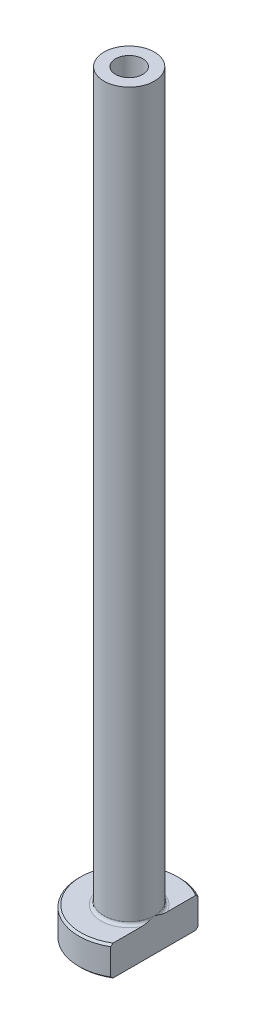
ISO-10303-21;
HEADER;
FILE_DESCRIPTION(('STEP AP214'),'2;1');
FILE_NAME('part.step','',(''),(''),'','','');
FILE_SCHEMA(('AUTOMOTIVE_DESIGN { 1 0 10303 214 1 1 1 1 }'));
ENDSEC;
DATA;
#1=APPLICATION_CONTEXT('core data for automotive mechanical design processes');
#2=APPLICATION_PROTOCOL_DEFINITION('international standard','automotive_design',2000,#1);
#3=PRODUCT_CONTEXT('',#1,'mechanical');
#4=PRODUCT('Part','Part','',(#3));
#5=PRODUCT_RELATED_PRODUCT_CATEGORY('part','',(#4));
#6=PRODUCT_DEFINITION_FORMATION('','',#4);
#7=PRODUCT_DEFINITION_CONTEXT('part definition',#1,'design');
#8=PRODUCT_DEFINITION('design','',#6,#7);
#9=PRODUCT_DEFINITION_SHAPE('','',#8);
#10=(LENGTH_UNIT() NAMED_UNIT(*) SI_UNIT(.MILLI.,.METRE.));
#11=(NAMED_UNIT(*) PLANE_ANGLE_UNIT() SI_UNIT($,.RADIAN.));
#12=(NAMED_UNIT(*) SI_UNIT($,.STERADIAN.) SOLID_ANGLE_UNIT());
#13=UNCERTAINTY_MEASURE_WITH_UNIT(LENGTH_MEASURE(1.E-05),#10,'distance_accuracy_value','');
#14=(GEOMETRIC_REPRESENTATION_CONTEXT(3) GLOBAL_UNCERTAINTY_ASSIGNED_CONTEXT((#13)) GLOBAL_UNIT_ASSIGNED_CONTEXT((#10,
#11,#12)) REPRESENTATION_CONTEXT('',''));
#15=CARTESIAN_POINT('',(0.,0.,0.));
#16=DIRECTION('',(0.,0.,1.));
#17=DIRECTION('',(1.,0.,0.));
#18=AXIS2_PLACEMENT_3D('',#15,#16,#17);
#19=CARTESIAN_POINT('',(0.,92.1876809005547,0.));
#20=DIRECTION('',(0.,1.,0.));
#21=DIRECTION('',(0.,0.,1.));
#22=AXIS2_PLACEMENT_3D('',#19,#20,#21);
#23=CYLINDRICAL_SURFACE('',#22,1.35000000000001);
#24=CARTESIAN_POINT('',(0.,75.,0.));
#25=DIRECTION('',(0.,1.,0.));
#26=DIRECTION('',(0.,0.,1.));
#27=AXIS2_PLACEMENT_3D('',#24,#25,#26);
#28=CIRCLE('',#27,1.35000000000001);
#29=CARTESIAN_POINT('',(0.,75.,1.35000000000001));
#30=VERTEX_POINT('',#29);
#31=EDGE_CURVE('E167',#30,#30,#28,.T.);
#32=ORIENTED_EDGE('',*,*,#31,.T.);
#33=EDGE_LOOP('',(#32));
#34=FACE_BOUND('',#33,.T.);
#35=CARTESIAN_POINT('',(0.,30.,0.));
#36=DIRECTION('',(0.,1.,0.));
#37=DIRECTION('',(0.,0.,1.));
#38=AXIS2_PLACEMENT_3D('',#35,#36,#37);
#39=CIRCLE('',#38,1.35000000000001);
#40=CARTESIAN_POINT('',(0.,30.,1.35000000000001));
#41=VERTEX_POINT('',#40);
#42=EDGE_CURVE('E170',#41,#41,#39,.T.);
#43=ORIENTED_EDGE('',*,*,#42,.F.);
#44=EDGE_LOOP('',(#43));
#45=FACE_BOUND('',#44,.T.);
#46=ADVANCED_FACE('F32',(#34,#45),#23,.F.);
#47=CARTESIAN_POINT('',(-1.35000000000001,75.,0.));
#48=DIRECTION('',(0.,1.,0.));
#49=DIRECTION('',(0.,0.,1.));
#50=AXIS2_PLACEMENT_3D('',#47,#48,#49);
#51=PLANE('',#50);
#52=CARTESIAN_POINT('',(0.,75.,0.));
#53=DIRECTION('',(0.,1.,0.));
#54=DIRECTION('',(0.,0.,1.));
#55=AXIS2_PLACEMENT_3D('',#52,#53,#54);
#56=CIRCLE('',#55,2.5);
#57=CARTESIAN_POINT('',(0.,75.,2.5));
#58=VERTEX_POINT('',#57);
#59=EDGE_CURVE('E174',#58,#58,#56,.T.);
#60=ORIENTED_EDGE('',*,*,#59,.T.);
#61=EDGE_LOOP('',(#60));
#62=FACE_BOUND('',#61,.T.);
#63=ORIENTED_EDGE('',*,*,#31,.F.);
#64=EDGE_LOOP('',(#63));
#65=FACE_BOUND('',#64,.T.);
#66=ADVANCED_FACE('F157',(#62,#65),#51,.T.);
#67=CARTESIAN_POINT('',(0.,92.1876809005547,0.));
#68=DIRECTION('',(0.,1.,0.));
#69=DIRECTION('',(0.,0.,1.));
#70=AXIS2_PLACEMENT_3D('',#67,#68,#69);
#71=CYLINDRICAL_SURFACE('',#70,2.49999999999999);
#72=CARTESIAN_POINT('',(0.,3.3,0.));
#73=DIRECTION('',(0.,1.,0.));
#74=DIRECTION('',(0.,0.,1.));
#75=AXIS2_PLACEMENT_3D('',#72,#73,#74);
#76=CIRCLE('',#75,2.49999999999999);
#77=CARTESIAN_POINT('',(2.49999999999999,3.3,0.));
#78=VERTEX_POINT('',#77);
#79=EDGE_CURVE('E180',#78,#78,#76,.T.);
#80=ORIENTED_EDGE('',*,*,#79,.T.);
#81=EDGE_LOOP('',(#80));
#82=FACE_BOUND('',#81,.T.);
#83=ORIENTED_EDGE('',*,*,#59,.F.);
#84=EDGE_LOOP('',(#83));
#85=FACE_BOUND('',#84,.T.);
#86=ADVANCED_FACE('F162',(#82,#85),#71,.T.);
#87=CARTESIAN_POINT('',(-2.49999999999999,3.,0.));
#88=DIRECTION('',(0.,1.,0.));
#89=DIRECTION('',(0.,0.,1.));
#90=AXIS2_PLACEMENT_3D('',#87,#88,#89);
#91=PLANE('',#90);
#92=DIRECTION('',(0.,0.,1.));
#93=VECTOR('',#92,1.);
#94=CARTESIAN_POINT('',(2.49999999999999,3.,0.));
#95=LINE('',#94,#93);
#96=CARTESIAN_POINT('',(2.5,3.,-4.09756024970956));
#97=VERTEX_POINT('',#96);
#98=CARTESIAN_POINT('',(2.49999999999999,3.,-1.26095202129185));
#99=VERTEX_POINT('',#98);
#100=EDGE_CURVE('E54',#97,#99,#95,.T.);
#101=ORIENTED_EDGE('',*,*,#100,.F.);
#102=CARTESIAN_POINT('',(0.,3.,0.));
#103=DIRECTION('',(0.,1.,0.));
#104=DIRECTION('',(0.,0.,1.));
#105=AXIS2_PLACEMENT_3D('',#102,#103,#104);
#106=CIRCLE('',#105,4.79999999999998);
#107=CARTESIAN_POINT('',(2.49999999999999,3.,4.09756024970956));
#108=VERTEX_POINT('',#107);
#109=EDGE_CURVE('E186',#97,#108,#106,.T.);
#110=ORIENTED_EDGE('',*,*,#109,.T.);
#111=CARTESIAN_POINT('',(2.49999999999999,3.,1.26095202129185));
#112=VERTEX_POINT('',#111);
#113=EDGE_CURVE('E134',#112,#108,#95,.T.);
#114=ORIENTED_EDGE('',*,*,#113,.F.);
#115=CARTESIAN_POINT('',(0.,3.,0.));
#116=DIRECTION('',(0.,1.,0.));
#117=DIRECTION('',(0.,0.,1.));
#118=AXIS2_PLACEMENT_3D('',#115,#116,#117);
#119=CIRCLE('',#118,2.79999999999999);
#120=EDGE_CURVE('E183',#112,#99,#119,.F.);
#121=ORIENTED_EDGE('',*,*,#120,.T.);
#122=EDGE_LOOP('',(#101,#110,#114,#121));
#123=FACE_BOUND('',#122,.T.);
#124=ADVANCED_FACE('F197',(#123),#91,.T.);
#125=CARTESIAN_POINT('',(0.,92.1876809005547,0.));
#126=DIRECTION('',(0.,1.,0.));
#127=DIRECTION('',(0.,0.,1.));
#128=AXIS2_PLACEMENT_3D('',#125,#126,#127);
#129=CYLINDRICAL_SURFACE('',#128,4.99999999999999);
#130=DIRECTION('',(0.,-1.,0.));
#131=VECTOR('',#130,1.);
#132=CARTESIAN_POINT('',(2.49999999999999,75.,4.33012701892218));
#133=LINE('',#132,#131);
#134=CARTESIAN_POINT('',(2.49999999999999,2.79999999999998,4.33012701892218));
#135=VERTEX_POINT('',#134);
#136=CARTESIAN_POINT('',(2.49999999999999,0.199999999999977,4.33012701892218));
#137=VERTEX_POINT('',#136);
#138=EDGE_CURVE('E82',#135,#137,#133,.T.);
#139=ORIENTED_EDGE('',*,*,#138,.F.);
#140=CARTESIAN_POINT('',(0.,2.79999999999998,0.));
#141=DIRECTION('',(0.,1.,0.));
#142=DIRECTION('',(0.,0.,1.));
#143=AXIS2_PLACEMENT_3D('',#140,#141,#142);
#144=CIRCLE('',#143,4.99999999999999);
#145=CARTESIAN_POINT('',(2.5,2.79999999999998,-4.33012701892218));
#146=VERTEX_POINT('',#145);
#147=EDGE_CURVE('E95',#135,#146,#144,.F.);
#148=ORIENTED_EDGE('',*,*,#147,.T.);
#149=DIRECTION('',(0.,-1.,0.));
#150=VECTOR('',#149,1.);
#151=CARTESIAN_POINT('',(2.5,75.,-4.33012701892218));
#152=LINE('',#151,#150);
#153=CARTESIAN_POINT('',(2.5,0.199999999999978,-4.33012701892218));
#154=VERTEX_POINT('',#153);
#155=EDGE_CURVE('E192',#146,#154,#152,.T.);
#156=ORIENTED_EDGE('',*,*,#155,.T.);
#157=CARTESIAN_POINT('',(0.,0.199999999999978,0.));
#158=DIRECTION('',(0.,-1.,0.));
#159=DIRECTION('',(0.,0.,-1.));
#160=AXIS2_PLACEMENT_3D('',#157,#158,#159);
#161=CIRCLE('',#160,4.99999999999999);
#162=EDGE_CURVE('E98',#154,#137,#161,.F.);
#163=ORIENTED_EDGE('',*,*,#162,.T.);
#164=EDGE_LOOP('',(#139,#148,#156,#163));
#165=FACE_BOUND('',#164,.T.);
#166=ADVANCED_FACE('F190',(#165),#129,.T.);
#167=CARTESIAN_POINT('',(-4.99999999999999,0.,0.));
#168=DIRECTION('',(0.,-1.,0.));
#169=DIRECTION('',(0.,0.,-1.));
#170=AXIS2_PLACEMENT_3D('',#167,#168,#169);
#171=PLANE('',#170);
#172=CARTESIAN_POINT('',(0.,0.,0.));
#173=DIRECTION('',(0.,-1.,0.));
#174=DIRECTION('',(0.,0.,-1.));
#175=AXIS2_PLACEMENT_3D('',#172,#173,#174);
#176=CIRCLE('',#175,2.09999999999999);
#177=CARTESIAN_POINT('',(0.,0.,-2.09999999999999));
#178=VERTEX_POINT('',#177);
#179=EDGE_CURVE('E40',#178,#178,#176,.F.);
#180=ORIENTED_EDGE('',*,*,#179,.T.);
#181=EDGE_LOOP('',(#180));
#182=FACE_BOUND('',#181,.T.);
#183=DIRECTION('',(0.,0.,-1.));
#184=VECTOR('',#183,1.);
#185=CARTESIAN_POINT('',(2.49999999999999,0.,4.33012701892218));
#186=LINE('',#185,#184);
#187=CARTESIAN_POINT('',(2.49999999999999,0.,4.09756024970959));
#188=VERTEX_POINT('',#187);
#189=CARTESIAN_POINT('',(2.5,0.,-4.09756024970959));
#190=VERTEX_POINT('',#189);
#191=EDGE_CURVE('E47',#188,#190,#186,.T.);
#192=ORIENTED_EDGE('',*,*,#191,.F.);
#193=CARTESIAN_POINT('',(0.,0.,0.));
#194=DIRECTION('',(0.,-1.,0.));
#195=DIRECTION('',(0.,0.,-1.));
#196=AXIS2_PLACEMENT_3D('',#193,#194,#195);
#197=CIRCLE('',#196,4.80000000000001);
#198=EDGE_CURVE('E92',#188,#190,#197,.T.);
#199=ORIENTED_EDGE('',*,*,#198,.T.);
#200=EDGE_LOOP('',(#192,#199));
#201=FACE_BOUND('',#200,.T.);
#202=ADVANCED_FACE('F91',(#182,#201),#171,.T.);
#203=CARTESIAN_POINT('',(0.,92.1876809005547,0.));
#204=DIRECTION('',(0.,1.,0.));
#205=DIRECTION('',(0.,0.,1.));
#206=AXIS2_PLACEMENT_3D('',#203,#204,#205);
#207=CYLINDRICAL_SURFACE('',#206,1.59999999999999);
#208=CARTESIAN_POINT('',(0.,0.5,0.));
#209=DIRECTION('',(0.,-1.,0.));
#210=DIRECTION('',(0.,0.,-1.));
#211=AXIS2_PLACEMENT_3D('',#208,#209,#210);
#212=CIRCLE('',#211,1.59999999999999);
#213=CARTESIAN_POINT('',(0.,0.5,-1.59999999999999));
#214=VERTEX_POINT('',#213);
#215=EDGE_CURVE('E11',#214,#214,#212,.T.);
#216=ORIENTED_EDGE('',*,*,#215,.T.);
#217=EDGE_LOOP('',(#216));
#218=FACE_BOUND('',#217,.T.);
#219=CARTESIAN_POINT('',(0.,18.,0.));
#220=DIRECTION('',(0.,1.,0.));
#221=DIRECTION('',(0.,0.,1.));
#222=AXIS2_PLACEMENT_3D('',#219,#220,#221);
#223=CIRCLE('',#222,1.59999999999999);
#224=CARTESIAN_POINT('',(0.,18.,1.59999999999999));
#225=VERTEX_POINT('',#224);
#226=EDGE_CURVE('E172',#225,#225,#223,.T.);
#227=ORIENTED_EDGE('',*,*,#226,.T.);
#228=EDGE_LOOP('',(#227));
#229=FACE_BOUND('',#228,.T.);
#230=ADVANCED_FACE('F215',(#218,#229),#207,.F.);
#231=CARTESIAN_POINT('',(0.,18.,0.));
#232=DIRECTION('',(0.,-1.,0.));
#233=DIRECTION('',(0.,0.,-1.));
#234=AXIS2_PLACEMENT_3D('',#231,#232,#233);
#235=CONICAL_SURFACE('',#234,1.59999999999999,0.0208303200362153);
#236=ORIENTED_EDGE('',*,*,#42,.T.);
#237=EDGE_LOOP('',(#236));
#238=FACE_BOUND('',#237,.T.);
#239=ORIENTED_EDGE('',*,*,#226,.F.);
#240=EDGE_LOOP('',(#239));
#241=FACE_BOUND('',#240,.T.);
#242=ADVANCED_FACE('F111',(#238,#241),#235,.F.);
#243=CARTESIAN_POINT('',(0.,3.3,0.));
#244=DIRECTION('',(0.,1.,0.));
#245=DIRECTION('',(0.,0.,1.));
#246=AXIS2_PLACEMENT_3D('',#243,#244,#245);
#247=TOROIDAL_SURFACE('',#246,2.79999999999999,0.3);
#248=ORIENTED_EDGE('',*,*,#120,.F.);
#249=CARTESIAN_POINT('',(2.49999999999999,3.3,0.));
#250=CARTESIAN_POINT('',(2.49999999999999,3.3000006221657,-4.84264874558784E-11));
#251=CARTESIAN_POINT('',(2.49999999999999,3.30000124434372,1.59620946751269E-07));
#252=CARTESIAN_POINT('',(2.49999999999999,3.30000243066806,6.45477700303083E-07));
#253=CARTESIAN_POINT('',(2.49999999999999,3.30000299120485,9.7848036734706E-07));
#254=CARTESIAN_POINT('',(2.49999999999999,3.30000411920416,1.774719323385E-06));
#255=CARTESIAN_POINT('',(2.49999999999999,3.30000467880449,2.24902086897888E-06));
#256=CARTESIAN_POINT('',(2.49999999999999,3.3000057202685,3.25953613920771E-06));
#257=CARTESIAN_POINT('',(2.49999999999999,3.30000620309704,3.7948067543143E-06));
#258=CARTESIAN_POINT('',(2.49999999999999,3.30000787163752,5.75794533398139E-06));
#259=CARTESIAN_POINT('',(2.49999999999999,3.30000896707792,7.26424002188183E-06));
#260=CARTESIAN_POINT('',(2.49999999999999,3.30001087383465,1.03361117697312E-05));
#261=CARTESIAN_POINT('',(2.49999999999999,3.30001169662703,1.18949488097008E-05));
#262=CARTESIAN_POINT('',(2.49999999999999,3.30001489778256,1.81400834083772E-05));
#263=CARTESIAN_POINT('',(2.49999999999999,3.30001712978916,2.29062155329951E-05));
#264=CARTESIAN_POINT('',(2.49999999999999,3.30002067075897,3.21793840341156E-05));
#265=CARTESIAN_POINT('',(2.49999999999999,3.30002205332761,3.66588963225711E-05));
#266=CARTESIAN_POINT('',(2.49999999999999,3.30002810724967,5.61718364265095E-05));
#267=CARTESIAN_POINT('',(2.49999999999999,3.30003284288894,7.11735811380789E-05));
#268=CARTESIAN_POINT('',(2.49999999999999,3.30004025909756,9.89920262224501E-05));
#269=CARTESIAN_POINT('',(2.49999999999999,3.30004315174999,0.000111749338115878));
#270=CARTESIAN_POINT('',(2.5,3.30006652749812,0.00020624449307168));
#271=CARTESIAN_POINT('',(2.5,3.3000969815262,0.000285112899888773));
#272=CARTESIAN_POINT('',(2.49999999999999,3.30021213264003,0.000594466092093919));
#273=CARTESIAN_POINT('',(2.49999999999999,3.30028938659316,0.0008269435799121));
#274=CARTESIAN_POINT('',(2.5,3.30059681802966,0.00173885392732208));
#275=CARTESIAN_POINT('',(2.5,3.30083479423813,0.00241625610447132));
#276=CARTESIAN_POINT('',(2.49999999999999,3.30181198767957,0.00521069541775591));
#277=CARTESIAN_POINT('',(2.49999999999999,3.30254240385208,0.00732996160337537));
#278=CARTESIAN_POINT('',(2.50000000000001,3.31226043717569,0.0355096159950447));
#279=CARTESIAN_POINT('',(2.5,3.32130808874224,0.0615551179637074));
#280=CARTESIAN_POINT('',(2.49999999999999,3.33896212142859,0.112677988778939));
#281=CARTESIAN_POINT('',(2.49999999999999,3.34757212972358,0.137754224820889));
#282=CARTESIAN_POINT('',(2.5,3.36573068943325,0.190981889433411));
#283=CARTESIAN_POINT('',(2.5,3.37526654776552,0.219137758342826));
#284=CARTESIAN_POINT('',(2.49999999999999,3.3942286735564,0.275816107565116));
#285=CARTESIAN_POINT('',(2.5,3.40365272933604,0.304339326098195));
#286=CARTESIAN_POINT('',(2.5,3.42641697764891,0.374416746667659));
#287=CARTESIAN_POINT('',(2.5,3.43959811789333,0.416023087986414));
#288=CARTESIAN_POINT('',(2.5,3.46479157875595,0.498481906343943));
#289=CARTESIAN_POINT('',(2.5,3.47682455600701,0.539328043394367));
#290=CARTESIAN_POINT('',(2.5,3.50224427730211,0.629981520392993));
#291=CARTESIAN_POINT('',(2.5,3.51538048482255,0.679860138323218));
#292=CARTESIAN_POINT('',(2.5,3.53964074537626,0.780511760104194));
#293=CARTESIAN_POINT('',(2.5,3.55074877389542,0.831288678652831));
#294=CARTESIAN_POINT('',(2.5,3.57087054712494,0.93706346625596));
#295=CARTESIAN_POINT('',(2.5,3.57967623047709,0.992102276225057));
#296=CARTESIAN_POINT('',(2.5,3.59301148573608,1.10256024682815));
#297=CARTESIAN_POINT('',(2.5,3.59755297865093,1.15797790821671));
#298=CARTESIAN_POINT('',(2.5,3.60093314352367,1.26786705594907));
#299=CARTESIAN_POINT('',(2.5,3.59989366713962,1.32233291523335));
#300=CARTESIAN_POINT('',(2.5,3.59277279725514,1.40310062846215));
#301=CARTESIAN_POINT('',(2.5,3.58952137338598,1.42965222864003));
#302=CARTESIAN_POINT('',(2.5,3.58085857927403,1.48239078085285));
#303=CARTESIAN_POINT('',(2.5,3.57544928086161,1.50857805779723));
#304=CARTESIAN_POINT('',(2.5,3.56298810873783,1.55658799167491));
#305=CARTESIAN_POINT('',(2.5,3.55628200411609,1.57849902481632));
#306=CARTESIAN_POINT('',(2.5,3.54055393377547,1.62160292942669));
#307=CARTESIAN_POINT('',(2.5,3.53152220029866,1.64279233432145));
#308=CARTESIAN_POINT('',(2.5,3.51057199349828,1.68404469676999));
#309=CARTESIAN_POINT('',(2.5,3.49862012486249,1.70409105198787));
#310=CARTESIAN_POINT('',(2.5,3.47134074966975,1.74172093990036));
#311=CARTESIAN_POINT('',(2.5,3.45603127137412,1.75931683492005));
#312=CARTESIAN_POINT('',(2.5,3.42979930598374,1.7829707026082));
#313=CARTESIAN_POINT('',(2.5,3.42024268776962,1.79054141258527));
#314=CARTESIAN_POINT('',(2.5,3.40009035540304,1.80416997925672));
#315=CARTESIAN_POINT('',(2.5,3.38949499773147,1.81022835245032));
#316=CARTESIAN_POINT('',(2.5,3.36727740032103,1.82047087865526));
#317=CARTESIAN_POINT('',(2.5,3.35564531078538,1.82463409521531));
#318=CARTESIAN_POINT('',(2.5,3.33178837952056,1.83058442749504));
#319=CARTESIAN_POINT('',(2.5,3.31956435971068,1.83237474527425));
#320=CARTESIAN_POINT('',(2.5,3.29665736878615,1.83331852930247));
#321=CARTESIAN_POINT('',(2.5,3.28598670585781,1.83279233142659));
#322=CARTESIAN_POINT('',(2.5,3.26490749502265,1.82986307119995));
#323=CARTESIAN_POINT('',(2.5,3.254498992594,1.82745968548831));
#324=CARTESIAN_POINT('',(2.5,3.23467098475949,1.8211125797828));
#325=CARTESIAN_POINT('',(2.5,3.22522816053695,1.81724026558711));
#326=CARTESIAN_POINT('',(2.5,3.20699535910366,1.80819497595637));
#327=CARTESIAN_POINT('',(2.5,3.19820556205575,1.8030216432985));
#328=CARTESIAN_POINT('',(2.5,3.17663162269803,1.78842115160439));
#329=CARTESIAN_POINT('',(2.5,3.16436228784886,1.77823293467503));
#330=CARTESIAN_POINT('',(2.5,3.14157828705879,1.75604629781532));
#331=CARTESIAN_POINT('',(2.5,3.13106906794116,1.74404246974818));
#332=CARTESIAN_POINT('',(2.5,3.10600520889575,1.71142114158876));
#333=CARTESIAN_POINT('',(2.5,3.09267476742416,1.68986887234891));
#334=CARTESIAN_POINT('',(2.5,3.06940323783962,1.64508572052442));
#335=CARTESIAN_POINT('',(2.5,3.0594631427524,1.62185434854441));
#336=CARTESIAN_POINT('',(2.5,3.03545750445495,1.55546754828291));
#337=CARTESIAN_POINT('',(2.5,3.02444022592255,1.51122187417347));
#338=CARTESIAN_POINT('',(2.5,3.00863926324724,1.42119777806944));
#339=CARTESIAN_POINT('',(2.5,3.00393876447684,1.37540689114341));
#340=CARTESIAN_POINT('',(2.5,2.99924212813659,1.28072198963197));
#341=CARTESIAN_POINT('',(2.5,2.99956098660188,1.23181420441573));
#342=CARTESIAN_POINT('',(2.5,3.00436098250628,1.13410944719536));
#343=CARTESIAN_POINT('',(2.5,3.00885327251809,1.08531312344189));
#344=CARTESIAN_POINT('',(2.5,3.02074191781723,0.990773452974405));
#345=CARTESIAN_POINT('',(2.5,3.02796792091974,0.945007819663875));
#346=CARTESIAN_POINT('',(2.5,3.04465555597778,0.854199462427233));
#347=CARTESIAN_POINT('',(2.5,3.05410250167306,0.809153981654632));
#348=CARTESIAN_POINT('',(2.5,3.07710029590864,0.709411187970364));
#349=CARTESIAN_POINT('',(2.5,3.0910963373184,0.654817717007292));
#350=CARTESIAN_POINT('',(2.5,3.12140740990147,0.544863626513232));
#351=CARTESIAN_POINT('',(2.5,3.13777040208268,0.489516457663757));
#352=CARTESIAN_POINT('',(2.5,3.16649540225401,0.396740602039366));
#353=CARTESIAN_POINT('',(2.49999999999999,3.17848130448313,0.359193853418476));
#354=CARTESIAN_POINT('',(2.5,3.20280507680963,0.284651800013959));
#355=CARTESIAN_POINT('',(2.5,3.21513791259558,0.247654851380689));
#356=CARTESIAN_POINT('',(2.49999999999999,3.23873713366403,0.177767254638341));
#357=CARTESIAN_POINT('',(2.49999999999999,3.24997409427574,0.144866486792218));
#358=CARTESIAN_POINT('',(2.5,3.27307149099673,0.0777985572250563));
#359=CARTESIAN_POINT('',(2.50000000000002,3.28493883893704,0.0436336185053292));
#360=CARTESIAN_POINT('',(2.49999999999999,3.29745794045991,0.00732879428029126));
#361=CARTESIAN_POINT('',(2.49999999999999,3.29818879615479,0.00520838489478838));
#362=CARTESIAN_POINT('',(2.5,3.29916610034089,0.00241367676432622));
#363=CARTESIAN_POINT('',(2.5,3.2994037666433,0.00173715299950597));
#364=CARTESIAN_POINT('',(2.49999999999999,3.29971082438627,0.000826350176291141));
#365=CARTESIAN_POINT('',(2.49999999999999,3.29978800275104,0.000594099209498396));
#366=CARTESIAN_POINT('',(2.5,3.29990305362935,0.000285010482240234));
#367=CARTESIAN_POINT('',(2.5,3.29993349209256,0.000206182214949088));
#368=CARTESIAN_POINT('',(2.49999999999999,3.29995685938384,0.000111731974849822));
#369=CARTESIAN_POINT('',(2.49999999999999,3.29995975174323,9.89774252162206E-05));
#370=CARTESIAN_POINT('',(2.49999999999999,3.29996716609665,7.11651824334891E-05));
#371=CARTESIAN_POINT('',(2.49999999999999,3.29997189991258,5.61668050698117E-05));
#372=CARTESIAN_POINT('',(2.49999999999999,3.29997795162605,3.66576298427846E-05));
#373=CARTESIAN_POINT('',(2.49999999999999,3.2999793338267,3.21785213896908E-05));
#374=CARTESIAN_POINT('',(2.49999999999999,3.29998287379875,2.29061348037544E-05));
#375=CARTESIAN_POINT('',(2.49999999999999,3.29998510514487,1.81403640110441E-05));
#376=CARTESIAN_POINT('',(2.49999999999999,3.29998830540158,1.18955808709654E-05));
#377=CARTESIAN_POINT('',(2.49999999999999,3.29998912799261,1.03367747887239E-05));
#378=CARTESIAN_POINT('',(2.49999999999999,3.29999103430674,7.26492657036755E-06));
#379=CARTESIAN_POINT('',(2.49999999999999,3.29999212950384,5.75862173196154E-06));
#380=CARTESIAN_POINT('',(2.49999999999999,3.29999379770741,3.79542390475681E-06));
#381=CARTESIAN_POINT('',(2.49999999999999,3.29999428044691,3.26012684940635E-06));
#382=CARTESIAN_POINT('',(2.49999999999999,3.2999953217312,2.24954267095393E-06));
#383=CARTESIAN_POINT('',(2.49999999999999,3.2999958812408,1.77519838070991E-06));
#384=CARTESIAN_POINT('',(2.49999999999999,3.29999700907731,9.78856700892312E-07));
#385=CARTESIAN_POINT('',(2.49999999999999,3.29999756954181,6.45796746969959E-07));
#386=CARTESIAN_POINT('',(2.49999999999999,3.29999875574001,1.59799482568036E-07));
#387=CARTESIAN_POINT('',(2.49999999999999,3.29999937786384,4.84246889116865E-11));
#388=CARTESIAN_POINT('',(2.49999999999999,3.3,0.));
#389=B_SPLINE_CURVE_WITH_KNOTS('',3,(#249,#250,#251,#252,#253,#254,#255,#256,#257,#258,#259,
#260,#261,#262,#263,#264,#265,#266,#267,#268,#269,#270,#271,#272,#273,#274,#275,#276,#277,#278,
#279,#280,#281,#282,#283,#284,#285,#286,#287,#288,#289,#290,#291,#292,#293,#294,#295,#296,#297,
#298,#299,#300,#301,#302,#303,#304,#305,#306,#307,#308,#309,#310,#311,#312,#313,#314,#315,#316,
#317,#318,#319,#320,#321,#322,#323,#324,#325,#326,#327,#328,#329,#330,#331,#332,#333,#334,#335,
#336,#337,#338,#339,#340,#341,#342,#343,#344,#345,#346,#347,#348,#349,#350,#351,#352,#353,#354,
#355,#356,#357,#358,#359,#360,#361,#362,#363,#364,#365,#366,#367,#368,#369,#370,#371,#372,#373,
#374,#375,#376,#377,#378,#379,#380,#381,#382,#383,#384,#385,#386,#387,#388),.UNSPECIFIED.,.T.,
.F.,(4,2,2,2,2,2,2,2,2,2,2,2,2,2,2,2,2,2,2,2,2,2,2,2,2,2,2,2,2,2,2,2,2,2,2,2,2,2,2,2,2,2,2,2,2,
2,2,2,2,2,2,2,2,2,2,2,2,2,2,2,2,2,2,2,2,2,2,2,2,4),(0.,1.86789357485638E-06,
3.81549845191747E-06,6.0061078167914E-06,8.16653364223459E-06,1.37285636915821E-05,
1.90122229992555E-05,3.47597349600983E-05,4.88082693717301E-05,9.59978501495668E-05,
0.000135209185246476,0.000388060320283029,0.00112364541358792,0.00327678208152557,
0.0100024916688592,0.0927120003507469,0.172253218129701,0.261432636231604,0.351551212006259,
0.482477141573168,0.610212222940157,0.764915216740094,0.920792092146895,1.08787897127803,
1.2544973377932,1.41749285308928,1.49767530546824,1.57778095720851,1.64642481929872,
1.7153618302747,1.78512750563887,1.85452737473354,1.89099315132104,1.92744645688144,
1.96429324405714,2.00109025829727,2.03297105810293,2.06485735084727,2.09535926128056,
2.12586955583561,2.17344034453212,2.22115572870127,2.29675134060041,2.3723690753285,
2.50839721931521,2.64619971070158,2.79268284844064,2.93955855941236,3.07848421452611,
3.21651583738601,3.38554045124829,3.55865938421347,3.67689643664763,3.79388863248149,
3.89819085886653,4.00668323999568,4.01341261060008,4.01556295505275,4.01629782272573,
4.01655054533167,4.01658974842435,4.01663692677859,4.01665097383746,4.01666671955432,
4.01667200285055,4.01667756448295,4.01667972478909,4.01668191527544,4.01668386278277,
4.01668573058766),.UNSPECIFIED.);
#390=EDGE_CURVE('E126',#112,#78,#389,.T.);
#391=ORIENTED_EDGE('',*,*,#390,.T.);
#392=ORIENTED_EDGE('',*,*,#79,.F.);
#393=CARTESIAN_POINT('',(2.49999999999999,3.3,0.));
#394=CARTESIAN_POINT('',(2.49999999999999,3.2999993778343,4.84269754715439E-11));
#395=CARTESIAN_POINT('',(2.49999999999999,3.29999875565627,-1.59620946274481E-07));
#396=CARTESIAN_POINT('',(2.49999999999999,3.29999756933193,-6.45477699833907E-07));
#397=CARTESIAN_POINT('',(2.49999999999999,3.29999700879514,-9.78480366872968E-07));
#398=CARTESIAN_POINT('',(2.49999999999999,3.29999588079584,-1.7747193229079E-06));
#399=CARTESIAN_POINT('',(2.49999999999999,3.29999532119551,-2.24902086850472E-06));
#400=CARTESIAN_POINT('',(2.49999999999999,3.29999427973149,-3.25953613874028E-06));
#401=CARTESIAN_POINT('',(2.49999999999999,3.29999379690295,-3.79480675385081E-06));
#402=CARTESIAN_POINT('',(2.49999999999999,3.29999212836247,-5.75794533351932E-06));
#403=CARTESIAN_POINT('',(2.49999999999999,3.29999103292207,-7.26424002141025E-06));
#404=CARTESIAN_POINT('',(2.49999999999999,3.29998912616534,-1.03361117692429E-05));
#405=CARTESIAN_POINT('',(2.49999999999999,3.29998830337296,-1.18949488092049E-05));
#406=CARTESIAN_POINT('',(2.49999999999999,3.29998510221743,-1.81400834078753E-05));
#407=CARTESIAN_POINT('',(2.49999999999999,3.29998287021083,-2.29062155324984E-05));
#408=CARTESIAN_POINT('',(2.49999999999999,3.29997932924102,-3.21793840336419E-05));
#409=CARTESIAN_POINT('',(2.49999999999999,3.29997794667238,-3.66588963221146E-05));
#410=CARTESIAN_POINT('',(2.49999999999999,3.29997189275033,-5.61718364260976E-05));
#411=CARTESIAN_POINT('',(2.49999999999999,3.29996715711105,-7.11735811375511E-05));
#412=CARTESIAN_POINT('',(2.49999999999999,3.29995974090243,-9.89920262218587E-05));
#413=CARTESIAN_POINT('',(2.49999999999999,3.29995684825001,-0.000111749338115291));
#414=CARTESIAN_POINT('',(2.5,3.29993347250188,-0.000206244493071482));
#415=CARTESIAN_POINT('',(2.5,3.2999030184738,-0.000285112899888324));
#416=CARTESIAN_POINT('',(2.49999999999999,3.29978786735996,-0.000594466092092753));
#417=CARTESIAN_POINT('',(2.49999999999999,3.29971061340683,-0.000826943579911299));
#418=CARTESIAN_POINT('',(2.5,3.29940318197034,-0.00173885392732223));
#419=CARTESIAN_POINT('',(2.5,3.29916520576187,-0.00241625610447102));
#420=CARTESIAN_POINT('',(2.49999999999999,3.29818801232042,-0.00521069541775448));
#421=CARTESIAN_POINT('',(2.49999999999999,3.29745759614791,-0.00732996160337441));
#422=CARTESIAN_POINT('',(2.50000000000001,3.28773956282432,-0.0355096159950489));
#423=CARTESIAN_POINT('',(2.5,3.27869191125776,-0.061555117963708));
#424=CARTESIAN_POINT('',(2.49999999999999,3.2610378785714,-0.112677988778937));
#425=CARTESIAN_POINT('',(2.49999999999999,3.25242787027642,-0.137754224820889));
#426=CARTESIAN_POINT('',(2.5,3.23426931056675,-0.190981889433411));
#427=CARTESIAN_POINT('',(2.5,3.22473345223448,-0.219137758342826));
#428=CARTESIAN_POINT('',(2.49999999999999,3.20577132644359,-0.275816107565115));
#429=CARTESIAN_POINT('',(2.5,3.19634727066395,-0.304339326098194));
#430=CARTESIAN_POINT('',(2.5,3.17358302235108,-0.374416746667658));
#431=CARTESIAN_POINT('',(2.5,3.16040188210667,-0.416023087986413));
#432=CARTESIAN_POINT('',(2.5,3.13520842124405,-0.498481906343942));
#433=CARTESIAN_POINT('',(2.5,3.12317544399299,-0.539328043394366));
#434=CARTESIAN_POINT('',(2.5,3.09775572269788,-0.629981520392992));
#435=CARTESIAN_POINT('',(2.5,3.08461951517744,-0.679860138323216));
#436=CARTESIAN_POINT('',(2.5,3.06035925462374,-0.780511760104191));
#437=CARTESIAN_POINT('',(2.5,3.04925122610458,-0.831288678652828));
#438=CARTESIAN_POINT('',(2.5,3.02912945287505,-0.937063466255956));
#439=CARTESIAN_POINT('',(2.5,3.02032376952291,-0.992102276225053));
#440=CARTESIAN_POINT('',(2.5,3.00698851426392,-1.10256024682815));
#441=CARTESIAN_POINT('',(2.5,3.00244702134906,-1.1579779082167));
#442=CARTESIAN_POINT('',(2.5,2.99906685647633,-1.26786705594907));
#443=CARTESIAN_POINT('',(2.5,3.00010633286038,-1.32233291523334));
#444=CARTESIAN_POINT('',(2.5,3.00722720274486,-1.40310062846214));
#445=CARTESIAN_POINT('',(2.5,3.01047862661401,-1.42965222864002));
#446=CARTESIAN_POINT('',(2.5,3.01914142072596,-1.48239078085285));
#447=CARTESIAN_POINT('',(2.5,3.02455071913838,-1.50857805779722));
#448=CARTESIAN_POINT('',(2.5,3.03701189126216,-1.5565879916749));
#449=CARTESIAN_POINT('',(2.5,3.04371799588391,-1.57849902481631));
#450=CARTESIAN_POINT('',(2.5,3.05944606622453,-1.62160292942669));
#451=CARTESIAN_POINT('',(2.5,3.06847779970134,-1.64279233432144));
#452=CARTESIAN_POINT('',(2.5,3.08942800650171,-1.68404469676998));
#453=CARTESIAN_POINT('',(2.5,3.1013798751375,-1.70409105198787));
#454=CARTESIAN_POINT('',(2.5,3.12865925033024,-1.74172093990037));
#455=CARTESIAN_POINT('',(2.5,3.14396872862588,-1.75931683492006));
#456=CARTESIAN_POINT('',(2.5,3.17020069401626,-1.7829707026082));
#457=CARTESIAN_POINT('',(2.5,3.17975731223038,-1.79054141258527));
#458=CARTESIAN_POINT('',(2.5,3.19990964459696,-1.80416997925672));
#459=CARTESIAN_POINT('',(2.5,3.21050500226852,-1.81022835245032));
#460=CARTESIAN_POINT('',(2.5,3.23272259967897,-1.82047087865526));
#461=CARTESIAN_POINT('',(2.5,3.24435468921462,-1.82463409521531));
#462=CARTESIAN_POINT('',(2.5,3.26821162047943,-1.83058442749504));
#463=CARTESIAN_POINT('',(2.5,3.28043564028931,-1.83237474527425));
#464=CARTESIAN_POINT('',(2.5,3.30334263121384,-1.83331852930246));
#465=CARTESIAN_POINT('',(2.5,3.31401329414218,-1.83279233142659));
#466=CARTESIAN_POINT('',(2.5,3.33509250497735,-1.82986307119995));
#467=CARTESIAN_POINT('',(2.5,3.345501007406,-1.82745968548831));
#468=CARTESIAN_POINT('',(2.5,3.36532901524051,-1.8211125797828));
#469=CARTESIAN_POINT('',(2.5,3.37477183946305,-1.81724026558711));
#470=CARTESIAN_POINT('',(2.5,3.39300464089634,-1.80819497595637));
#471=CARTESIAN_POINT('',(2.5,3.40179443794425,-1.8030216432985));
#472=CARTESIAN_POINT('',(2.5,3.42336837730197,-1.78842115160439));
#473=CARTESIAN_POINT('',(2.5,3.43563771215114,-1.77823293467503));
#474=CARTESIAN_POINT('',(2.5,3.45842171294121,-1.75604629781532));
#475=CARTESIAN_POINT('',(2.5,3.46893093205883,-1.74404246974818));
#476=CARTESIAN_POINT('',(2.5,3.49399479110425,-1.71142114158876));
#477=CARTESIAN_POINT('',(2.5,3.50732523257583,-1.68986887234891));
#478=CARTESIAN_POINT('',(2.5,3.53059676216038,-1.64508572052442));
#479=CARTESIAN_POINT('',(2.5,3.5405368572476,-1.6218543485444));
#480=CARTESIAN_POINT('',(2.5,3.56454249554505,-1.5554675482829));
#481=CARTESIAN_POINT('',(2.5,3.57555977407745,-1.51122187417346));
#482=CARTESIAN_POINT('',(2.5,3.59136073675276,-1.42119777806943));
#483=CARTESIAN_POINT('',(2.5,3.59606123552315,-1.37540689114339));
#484=CARTESIAN_POINT('',(2.5,3.6007578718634,-1.28072198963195));
#485=CARTESIAN_POINT('',(2.5,3.60043901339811,-1.23181420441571));
#486=CARTESIAN_POINT('',(2.5,3.59563901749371,-1.13410944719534));
#487=CARTESIAN_POINT('',(2.5,3.5911467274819,-1.08531312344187));
#488=CARTESIAN_POINT('',(2.5,3.57925808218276,-0.99077345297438));
#489=CARTESIAN_POINT('',(2.5,3.57203207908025,-0.945007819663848));
#490=CARTESIAN_POINT('',(2.5,3.55534444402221,-0.854199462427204));
#491=CARTESIAN_POINT('',(2.5,3.54589749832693,-0.809153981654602));
#492=CARTESIAN_POINT('',(2.5,3.52289970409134,-0.709411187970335));
#493=CARTESIAN_POINT('',(2.5,3.50890366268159,-0.654817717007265));
#494=CARTESIAN_POINT('',(2.5,3.47859259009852,-0.54486362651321));
#495=CARTESIAN_POINT('',(2.5,3.46222959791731,-0.489516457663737));
#496=CARTESIAN_POINT('',(2.5,3.43350459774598,-0.39674060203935));
#497=CARTESIAN_POINT('',(2.49999999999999,3.42151869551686,-0.359193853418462));
#498=CARTESIAN_POINT('',(2.5,3.39719492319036,-0.284651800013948));
#499=CARTESIAN_POINT('',(2.5,3.38486208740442,-0.247654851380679));
#500=CARTESIAN_POINT('',(2.49999999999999,3.36126286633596,-0.177767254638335));
#501=CARTESIAN_POINT('',(2.49999999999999,3.35002590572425,-0.144866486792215));
#502=CARTESIAN_POINT('',(2.5,3.32692850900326,-0.077798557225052));
#503=CARTESIAN_POINT('',(2.50000000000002,3.31506116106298,-0.0436336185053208));
#504=CARTESIAN_POINT('',(2.49999999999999,3.30254205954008,-0.00732879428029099));
#505=CARTESIAN_POINT('',(2.49999999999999,3.3018112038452,-0.00520838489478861));
#506=CARTESIAN_POINT('',(2.5,3.30083389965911,-0.0024136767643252));
#507=CARTESIAN_POINT('',(2.5,3.3005962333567,-0.0017371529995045));
#508=CARTESIAN_POINT('',(2.49999999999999,3.30028917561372,-0.000826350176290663));
#509=CARTESIAN_POINT('',(2.49999999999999,3.30021199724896,-0.00059409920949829));
#510=CARTESIAN_POINT('',(2.5,3.30009694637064,-0.000285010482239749));
#511=CARTESIAN_POINT('',(2.5,3.30006650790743,-0.000206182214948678));
#512=CARTESIAN_POINT('',(2.49999999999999,3.30004314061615,-0.000111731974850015));
#513=CARTESIAN_POINT('',(2.49999999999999,3.30004024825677,-9.89774252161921E-05));
#514=CARTESIAN_POINT('',(2.49999999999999,3.30003283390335,-7.1165182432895E-05));
#515=CARTESIAN_POINT('',(2.49999999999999,3.30002810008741,-5.61668050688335E-05));
#516=CARTESIAN_POINT('',(2.49999999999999,3.30002204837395,-3.66576298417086E-05));
#517=CARTESIAN_POINT('',(2.49999999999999,3.3000206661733,-3.21785213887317E-05));
#518=CARTESIAN_POINT('',(2.49999999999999,3.30001712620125,-2.29061348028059E-05));
#519=CARTESIAN_POINT('',(2.49999999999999,3.30001489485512,-1.81403640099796E-05));
#520=CARTESIAN_POINT('',(2.49999999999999,3.30001169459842,-1.18955808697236E-05));
#521=CARTESIAN_POINT('',(2.49999999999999,3.30001087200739,-1.03367747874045E-05));
#522=CARTESIAN_POINT('',(2.49999999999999,3.30000896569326,-7.26492656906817E-06));
#523=CARTESIAN_POINT('',(2.49999999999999,3.30000787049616,-5.75862173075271E-06));
#524=CARTESIAN_POINT('',(2.49999999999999,3.30000620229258,-3.7954239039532E-06));
#525=CARTESIAN_POINT('',(2.49999999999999,3.30000571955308,-3.26012684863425E-06));
#526=CARTESIAN_POINT('',(2.49999999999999,3.30000467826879,-2.2495426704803E-06));
#527=CARTESIAN_POINT('',(2.49999999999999,3.3000041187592,-1.77519838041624E-06));
#528=CARTESIAN_POINT('',(2.49999999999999,3.30000299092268,-9.78856700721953E-07));
#529=CARTESIAN_POINT('',(2.49999999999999,3.30000243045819,-6.45796746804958E-07));
#530=CARTESIAN_POINT('',(2.49999999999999,3.30000124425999,-1.59799482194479E-07));
#531=CARTESIAN_POINT('',(2.49999999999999,3.30000062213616,-4.84241754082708E-11));
#532=CARTESIAN_POINT('',(2.49999999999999,3.3,0.));
#533=B_SPLINE_CURVE_WITH_KNOTS('',3,(#393,#394,#395,#396,#397,#398,#399,#400,#401,#402,#403,
#404,#405,#406,#407,#408,#409,#410,#411,#412,#413,#414,#415,#416,#417,#418,#419,#420,#421,#422,
#423,#424,#425,#426,#427,#428,#429,#430,#431,#432,#433,#434,#435,#436,#437,#438,#439,#440,#441,
#442,#443,#444,#445,#446,#447,#448,#449,#450,#451,#452,#453,#454,#455,#456,#457,#458,#459,#460,
#461,#462,#463,#464,#465,#466,#467,#468,#469,#470,#471,#472,#473,#474,#475,#476,#477,#478,#479,
#480,#481,#482,#483,#484,#485,#486,#487,#488,#489,#490,#491,#492,#493,#494,#495,#496,#497,#498,
#499,#500,#501,#502,#503,#504,#505,#506,#507,#508,#509,#510,#511,#512,#513,#514,#515,#516,#517,
#518,#519,#520,#521,#522,#523,#524,#525,#526,#527,#528,#529,#530,#531,#532),.UNSPECIFIED.,.T.,
.F.,(4,2,2,2,2,2,2,2,2,2,2,2,2,2,2,2,2,2,2,2,2,2,2,2,2,2,2,2,2,2,2,2,2,2,2,2,2,2,2,2,2,2,2,2,2,
2,2,2,2,2,2,2,2,2,2,2,2,2,2,2,2,2,2,2,2,2,2,2,2,4),(0.,1.86789357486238E-06,
3.81549845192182E-06,6.00610781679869E-06,8.1665336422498E-06,1.37285636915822E-05,
1.90122229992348E-05,3.47597349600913E-05,4.88082693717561E-05,9.5997850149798E-05,
0.000135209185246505,0.000388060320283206,0.00112364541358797,0.00327678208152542,
0.0100024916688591,0.0927120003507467,0.172253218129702,0.261432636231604,0.351551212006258,
0.482477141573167,0.610212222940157,0.764915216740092,0.920792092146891,1.08787897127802,
1.2544973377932,1.41749285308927,1.49767530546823,1.5777809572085,1.64642481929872,
1.71536183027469,1.78512750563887,1.85452737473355,1.89099315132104,1.92744645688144,
1.96429324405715,2.00109025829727,2.03297105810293,2.06485735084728,2.09535926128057,
2.12586955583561,2.17344034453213,2.22115572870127,2.29675134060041,2.37236907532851,
2.50839721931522,2.64619971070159,2.79268284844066,2.93955855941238,3.07848421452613,
3.21651583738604,3.38554045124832,3.55865938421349,3.67689643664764,3.7938886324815,
3.89819085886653,4.00668323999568,4.01341261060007,4.01556295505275,4.01629782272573,
4.01655054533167,4.01658974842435,4.01663692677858,4.01665097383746,4.01666671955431,
4.01667200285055,4.01667756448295,4.01667972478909,4.01668191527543,4.01668386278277,
4.01668573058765),.UNSPECIFIED.);
#534=EDGE_CURVE('E135',#78,#99,#533,.T.);
#535=ORIENTED_EDGE('',*,*,#534,.T.);
#536=EDGE_LOOP('',(#248,#391,#392,#535));
#537=FACE_BOUND('',#536,.T.);
#538=ADVANCED_FACE('F141',(#537),#247,.F.);
#539=CARTESIAN_POINT('',(0.,3.,0.));
#540=DIRECTION('',(0.,-1.,0.));
#541=DIRECTION('',(0.,0.,-1.));
#542=AXIS2_PLACEMENT_3D('',#539,#540,#541);
#543=CONICAL_SURFACE('',#542,4.79999999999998,0.785398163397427);
#544=CARTESIAN_POINT('',(2.5,-2.05039133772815,-9.52786489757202));
#545=CARTESIAN_POINT('',(2.5,-1.84160367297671,-9.31199733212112));
#546=CARTESIAN_POINT('',(2.5,-1.63304008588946,-9.09591231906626));
#547=CARTESIAN_POINT('',(2.5,-1.21649358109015,-8.66317810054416));
#548=CARTESIAN_POINT('',(2.5,-1.00851067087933,-8.44652888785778));
#549=CARTESIAN_POINT('',(2.5,-0.593157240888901,-8.01243155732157));
#550=CARTESIAN_POINT('',(2.5,-0.38578708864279,-7.79498308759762));
#551=CARTESIAN_POINT('',(2.5,0.0280365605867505,-7.35921771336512));
#552=CARTESIAN_POINT('',(2.5,0.234490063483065,-7.14090081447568));
#553=CARTESIAN_POINT('',(2.5,0.642130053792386,-6.70748960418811));
#554=CARTESIAN_POINT('',(2.5,0.843339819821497,-6.49241720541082));
#555=CARTESIAN_POINT('',(2.5,1.24425381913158,-6.06087422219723));
#556=CARTESIAN_POINT('',(2.5,1.44395806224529,-5.84440364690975));
#557=CARTESIAN_POINT('',(2.5,1.84127751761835,-5.40963663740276));
#558=CARTESIAN_POINT('',(2.5,2.03889317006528,-5.19134060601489));
#559=CARTESIAN_POINT('',(2.5,2.43125043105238,-4.75218509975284));
#560=CARTESIAN_POINT('',(2.5,2.62599215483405,-4.53132572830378));
#561=CARTESIAN_POINT('',(2.5,2.93693788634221,-4.17181619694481));
#562=CARTESIAN_POINT('',(2.5,3.05446493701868,-4.03431188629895));
#563=CARTESIAN_POINT('',(2.5,3.28742704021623,-3.75751486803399));
#564=CARTESIAN_POINT('',(2.5,3.40286188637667,-3.61822198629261));
#565=CARTESIAN_POINT('',(2.5,3.63213234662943,-3.33586492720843));
#566=CARTESIAN_POINT('',(2.5,3.7459381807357,-3.19277645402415));
#567=CARTESIAN_POINT('',(2.5,3.96956266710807,-2.90356071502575));
#568=CARTESIAN_POINT('',(2.5,4.07938227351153,-2.75743418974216));
#569=CARTESIAN_POINT('',(2.5,4.29502410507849,-2.45881038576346));
#570=CARTESIAN_POINT('',(2.5,4.40076032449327,-2.30625006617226));
#571=CARTESIAN_POINT('',(2.5,4.55286945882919,-2.07299325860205));
#572=CARTESIAN_POINT('',(2.5,4.60252613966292,-1.99444197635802));
#573=CARTESIAN_POINT('',(2.5,4.69908164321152,-1.83566827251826));
#574=CARTESIAN_POINT('',(2.5,4.74598077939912,-1.75544604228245));
#575=CARTESIAN_POINT('',(2.5,4.83578466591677,-1.59405362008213));
#576=CARTESIAN_POINT('',(2.5,4.87873126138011,-1.51290702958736));
#577=CARTESIAN_POINT('',(2.5,4.96038600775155,-1.34852090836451));
#578=CARTESIAN_POINT('',(2.5,4.99909338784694,-1.26528100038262));
#579=CARTESIAN_POINT('',(2.5,5.10703093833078,-1.01251774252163));
#580=CARTESIAN_POINT('',(2.5,5.16843307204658,-0.839342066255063));
#581=CARTESIAN_POINT('',(2.5,5.23490554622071,-0.57970344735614));
#582=CARTESIAN_POINT('',(2.5,5.25253806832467,-0.496421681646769));
#583=CARTESIAN_POINT('',(2.5,5.2798633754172,-0.328535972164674));
#584=CARTESIAN_POINT('',(2.5,5.28955686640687,-0.243932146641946));
#585=CARTESIAN_POINT('',(2.5,5.30031768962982,-0.0744340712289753));
#586=CARTESIAN_POINT('',(2.5,5.30141176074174,0.0104584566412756));
#587=CARTESIAN_POINT('',(2.5,5.29496530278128,0.179916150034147));
#588=CARTESIAN_POINT('',(2.5,5.28742406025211,0.264481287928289));
#589=CARTESIAN_POINT('',(2.5,5.26433424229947,0.431754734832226));
#590=CARTESIAN_POINT('',(2.5,5.2488543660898,0.514472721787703));
#591=CARTESIAN_POINT('',(2.5,5.21085318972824,0.678257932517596));
#592=CARTESIAN_POINT('',(2.5,5.18833104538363,0.759324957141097));
#593=CARTESIAN_POINT('',(2.5,5.13718929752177,0.920001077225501));
#594=CARTESIAN_POINT('',(2.5,5.10853534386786,0.999599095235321));
#595=CARTESIAN_POINT('',(2.5,5.0462809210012,1.15679278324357));
#596=CARTESIAN_POINT('',(2.5,5.01268146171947,1.23438885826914));
#597=CARTESIAN_POINT('',(2.5,4.90558195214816,1.46503672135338));
#598=CARTESIAN_POINT('',(2.5,4.82601567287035,1.61526350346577));
#599=CARTESIAN_POINT('',(2.5,4.65635232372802,1.90970759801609));
#600=CARTESIAN_POINT('',(2.49999999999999,4.56624199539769,2.0539170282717));
#601=CARTESIAN_POINT('',(2.49999999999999,4.37862201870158,2.33821627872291));
#602=CARTESIAN_POINT('',(2.49999999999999,4.28108460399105,2.47828761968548));
#603=CARTESIAN_POINT('',(2.49999999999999,4.08116271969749,2.75478641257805));
#604=CARTESIAN_POINT('',(2.49999999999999,3.97878070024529,2.89121565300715));
#605=CARTESIAN_POINT('',(2.49999999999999,3.76913910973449,3.16313520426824));
#606=CARTESIAN_POINT('',(2.49999999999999,3.66183307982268,3.29858952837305));
#607=CARTESIAN_POINT('',(2.49999999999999,3.44456217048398,3.56736427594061));
#608=CARTESIAN_POINT('',(2.49999999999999,3.3345970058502,3.70068446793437));
#609=CARTESIAN_POINT('',(2.49999999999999,3.1129346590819,3.965323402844));
#610=CARTESIAN_POINT('',(2.49999999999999,3.00124232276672,4.09664621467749));
#611=CARTESIAN_POINT('',(2.49999999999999,2.7763127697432,4.35796341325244));
#612=CARTESIAN_POINT('',(2.49999999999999,2.66307552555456,4.48795777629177));
#613=CARTESIAN_POINT('',(2.49999999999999,2.36028773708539,4.83228553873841));
#614=CARTESIAN_POINT('',(2.49999999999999,2.16967435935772,5.04568363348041));
#615=CARTESIAN_POINT('',(2.49999999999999,1.78611780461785,5.47037913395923));
#616=CARTESIAN_POINT('',(2.49999999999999,1.59317456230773,5.68167648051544));
#617=CARTESIAN_POINT('',(2.49999999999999,1.20540648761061,6.10290357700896));
#618=CARTESIAN_POINT('',(2.49999999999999,1.01058005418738,6.31283185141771));
#619=CARTESIAN_POINT('',(2.49999999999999,0.619649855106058,6.73149551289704));
#620=CARTESIAN_POINT('',(2.49999999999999,0.423546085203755,6.94023089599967));
#621=CARTESIAN_POINT('',(2.49999999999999,0.0384434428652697,7.34820392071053));
#622=CARTESIAN_POINT('',(2.49999999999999,-0.150515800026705,7.54747899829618));
#623=CARTESIAN_POINT('',(2.49999999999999,-0.529153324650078,7.94534601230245));
#624=CARTESIAN_POINT('',(2.49999999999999,-0.718831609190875,8.14393794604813));
#625=CARTESIAN_POINT('',(2.49999999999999,-1.09855461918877,8.54034636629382));
#626=CARTESIAN_POINT('',(2.49999999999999,-1.28859869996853,8.73816347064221));
#627=CARTESIAN_POINT('',(2.49999999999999,-1.66916268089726,9.1333363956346));
#628=CARTESIAN_POINT('',(2.49999999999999,-1.8596825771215,9.3306922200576));
#629=CARTESIAN_POINT('',(2.49999999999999,-2.05039133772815,9.52786489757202));
#630=B_SPLINE_CURVE_WITH_KNOTS('',3,(#544,#545,#546,#547,#548,#549,#550,#551,#552,#553,#554,
#555,#556,#557,#558,#559,#560,#561,#562,#563,#564,#565,#566,#567,#568,#569,#570,#571,#572,#573,
#574,#575,#576,#577,#578,#579,#580,#581,#582,#583,#584,#585,#586,#587,#588,#589,#590,#591,#592,
#593,#594,#595,#596,#597,#598,#599,#600,#601,#602,#603,#604,#605,#606,#607,#608,#609,#610,#611,
#612,#613,#614,#615,#616,#617,#618,#619,#620,#621,#622,#623,#624,#625,#626,#627,#628,#629),
.UNSPECIFIED.,.F.,.F.,(4,2,2,2,2,2,2,2,2,2,2,2,2,2,2,2,2,2,2,2,2,2,2,2,2,2,2,2,2,2,2,2,2,2,2,2,
2,2,2,2,2,2,4),(0.,0.900955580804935,1.80192274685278,2.70335062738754,3.60477268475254,
4.48832484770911,5.37187123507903,6.2552275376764,7.13854832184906,7.681193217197,
8.22389134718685,8.77232299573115,9.32062249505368,9.87724663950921,10.1559936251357,
10.4347088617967,10.7100145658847,10.9853702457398,11.5339745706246,11.7890461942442,
12.0440951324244,12.2983507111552,12.5526272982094,12.804739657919,13.056882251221,
13.3104761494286,13.5640183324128,14.073261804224,14.5831526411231,15.0950533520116,
15.6066978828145,16.1250759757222,16.6435099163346,17.1606868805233,17.677873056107,
18.5362451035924,19.3946412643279,20.2538459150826,21.1130534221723,21.9369112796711,
22.7607723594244,23.5837145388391,24.4066499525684),.UNSPECIFIED.);
#631=EDGE_CURVE('E133',#146,#97,#630,.T.);
#632=ORIENTED_EDGE('',*,*,#631,.F.);
#633=ORIENTED_EDGE('',*,*,#147,.F.);
#634=EDGE_CURVE('E118',#108,#135,#630,.T.);
#635=ORIENTED_EDGE('',*,*,#634,.F.);
#636=ORIENTED_EDGE('',*,*,#109,.F.);
#637=EDGE_LOOP('',(#632,#633,#635,#636));
#638=FACE_BOUND('',#637,.T.);
#639=ADVANCED_FACE('F145',(#638),#543,.T.);
#640=CARTESIAN_POINT('',(0.,0.199999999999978,0.));
#641=DIRECTION('',(0.,1.,0.));
#642=DIRECTION('',(0.,0.,1.));
#643=AXIS2_PLACEMENT_3D('',#640,#641,#642);
#644=CONICAL_SURFACE('',#643,4.99999999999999,0.785398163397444);
#645=CARTESIAN_POINT('',(2.49999999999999,5.05039133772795,9.52786489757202));
#646=CARTESIAN_POINT('',(2.49999999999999,4.84160367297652,9.31199733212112));
#647=CARTESIAN_POINT('',(2.49999999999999,4.63304008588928,9.09591231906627));
#648=CARTESIAN_POINT('',(2.49999999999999,4.21649358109,8.66317810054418));
#649=CARTESIAN_POINT('',(2.49999999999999,4.00851067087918,8.4465288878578));
#650=CARTESIAN_POINT('',(2.49999999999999,3.59315724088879,8.01243155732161));
#651=CARTESIAN_POINT('',(2.49999999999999,3.38578708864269,7.79498308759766));
#652=CARTESIAN_POINT('',(2.49999999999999,2.97196343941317,7.35921771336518));
#653=CARTESIAN_POINT('',(2.49999999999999,2.76550993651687,7.14090081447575));
#654=CARTESIAN_POINT('',(2.49999999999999,2.35786994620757,6.70748960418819));
#655=CARTESIAN_POINT('',(2.49999999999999,2.15666018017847,6.49241720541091));
#656=CARTESIAN_POINT('',(2.49999999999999,1.75574618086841,6.06087422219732));
#657=CARTESIAN_POINT('',(2.49999999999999,1.55604193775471,5.84440364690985));
#658=CARTESIAN_POINT('',(2.49999999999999,1.15872248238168,5.40963663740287));
#659=CARTESIAN_POINT('',(2.49999999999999,0.961106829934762,5.191340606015));
#660=CARTESIAN_POINT('',(2.49999999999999,0.568749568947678,4.75218509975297));
#661=CARTESIAN_POINT('',(2.49999999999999,0.374007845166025,4.53132572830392));
#662=CARTESIAN_POINT('',(2.49999999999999,0.063062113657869,4.17181619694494));
#663=CARTESIAN_POINT('',(2.49999999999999,-0.0544649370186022,4.03431188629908));
#664=CARTESIAN_POINT('',(2.49999999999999,-0.287427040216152,3.75751486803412));
#665=CARTESIAN_POINT('',(2.49999999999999,-0.402861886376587,3.61822198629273));
#666=CARTESIAN_POINT('',(2.49999999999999,-0.632132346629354,3.33586492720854));
#667=CARTESIAN_POINT('',(2.49999999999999,-0.745938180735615,3.19277645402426));
#668=CARTESIAN_POINT('',(2.49999999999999,-0.969562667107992,2.90356071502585));
#669=CARTESIAN_POINT('',(2.49999999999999,-1.07938227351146,2.75743418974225));
#670=CARTESIAN_POINT('',(2.49999999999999,-1.29502410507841,2.45881038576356));
#671=CARTESIAN_POINT('',(2.5,-1.4007603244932,2.30625006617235));
#672=CARTESIAN_POINT('',(2.5,-1.55286945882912,2.07299325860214));
#673=CARTESIAN_POINT('',(2.5,-1.60252613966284,1.99444197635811));
#674=CARTESIAN_POINT('',(2.5,-1.69908164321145,1.83566827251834));
#675=CARTESIAN_POINT('',(2.5,-1.74598077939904,1.75544604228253));
#676=CARTESIAN_POINT('',(2.5,-1.8357846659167,1.59405362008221));
#677=CARTESIAN_POINT('',(2.5,-1.87873126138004,1.51290702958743));
#678=CARTESIAN_POINT('',(2.5,-1.96038600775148,1.34852090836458));
#679=CARTESIAN_POINT('',(2.5,-1.99909338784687,1.26528100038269));
#680=CARTESIAN_POINT('',(2.5,-2.10703093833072,1.0125177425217));
#681=CARTESIAN_POINT('',(2.5,-2.16843307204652,0.839342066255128));
#682=CARTESIAN_POINT('',(2.5,-2.23490554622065,0.579703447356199));
#683=CARTESIAN_POINT('',(2.5,-2.25253806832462,0.496421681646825));
#684=CARTESIAN_POINT('',(2.5,-2.27986337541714,0.328535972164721));
#685=CARTESIAN_POINT('',(2.5,-2.28955686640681,0.24393214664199));
#686=CARTESIAN_POINT('',(2.5,-2.30031768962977,0.0744340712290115));
#687=CARTESIAN_POINT('',(2.5,-2.30141176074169,-0.0104584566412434));
#688=CARTESIAN_POINT('',(2.5,-2.29496530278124,-0.179916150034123));
#689=CARTESIAN_POINT('',(2.5,-2.28742406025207,-0.26448128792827));
#690=CARTESIAN_POINT('',(2.5,-2.26433424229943,-0.431754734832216));
#691=CARTESIAN_POINT('',(2.5,-2.24885436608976,-0.514472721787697));
#692=CARTESIAN_POINT('',(2.5,-2.21085318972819,-0.678257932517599));
#693=CARTESIAN_POINT('',(2.5,-2.18833104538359,-0.759324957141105));
#694=CARTESIAN_POINT('',(2.5,-2.13718929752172,-0.920001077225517));
#695=CARTESIAN_POINT('',(2.5,-2.10853534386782,-0.99959909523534));
#696=CARTESIAN_POINT('',(2.5,-2.04628092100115,-1.15679278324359));
#697=CARTESIAN_POINT('',(2.5,-2.01268146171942,-1.23438885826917));
#698=CARTESIAN_POINT('',(2.5,-1.90558195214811,-1.46503672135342));
#699=CARTESIAN_POINT('',(2.5,-1.82601567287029,-1.61526350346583));
#700=CARTESIAN_POINT('',(2.5,-1.65635232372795,-1.90970759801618));
#701=CARTESIAN_POINT('',(2.5,-1.56624199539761,-2.0539170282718));
#702=CARTESIAN_POINT('',(2.5,-1.37862201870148,-2.33821627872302));
#703=CARTESIAN_POINT('',(2.5,-1.28108460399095,-2.4782876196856));
#704=CARTESIAN_POINT('',(2.5,-1.08116271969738,-2.7547864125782));
#705=CARTESIAN_POINT('',(2.5,-0.97878070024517,-2.89121565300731));
#706=CARTESIAN_POINT('',(2.5,-0.769139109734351,-3.16313520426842));
#707=CARTESIAN_POINT('',(2.5,-0.661833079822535,-3.29858952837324));
#708=CARTESIAN_POINT('',(2.5,-0.444562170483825,-3.56736427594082));
#709=CARTESIAN_POINT('',(2.5,-0.334597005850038,-3.70068446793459));
#710=CARTESIAN_POINT('',(2.5,-0.112934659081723,-3.96532340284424));
#711=CARTESIAN_POINT('',(2.5,-0.00124232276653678,-4.09664621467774));
#712=CARTESIAN_POINT('',(2.5,0.223687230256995,-4.35796341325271));
#713=CARTESIAN_POINT('',(2.5,0.336924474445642,-4.48795777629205));
#714=CARTESIAN_POINT('',(2.5,0.639712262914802,-4.83228553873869));
#715=CARTESIAN_POINT('',(2.5,0.830325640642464,-5.04568363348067));
#716=CARTESIAN_POINT('',(2.5,1.2138821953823,-5.47037913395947));
#717=CARTESIAN_POINT('',(2.5,1.4068254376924,-5.68167648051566));
#718=CARTESIAN_POINT('',(2.5,1.79459351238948,-6.10290357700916));
#719=CARTESIAN_POINT('',(2.5,1.98941994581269,-6.3128318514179));
#720=CARTESIAN_POINT('',(2.5,2.38035014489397,-6.7314955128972));
#721=CARTESIAN_POINT('',(2.5,2.57645391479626,-6.94023089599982));
#722=CARTESIAN_POINT('',(2.5,2.96155655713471,-7.34820392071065));
#723=CARTESIAN_POINT('',(2.5,3.15051580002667,-7.54747899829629));
#724=CARTESIAN_POINT('',(2.5,3.52915332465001,-7.94534601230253));
#725=CARTESIAN_POINT('',(2.5,3.71883160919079,-8.14393794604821));
#726=CARTESIAN_POINT('',(2.5,4.09855461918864,-8.54034636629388));
#727=CARTESIAN_POINT('',(2.5,4.28859869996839,-8.73816347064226));
#728=CARTESIAN_POINT('',(2.5,4.66916268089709,-9.13333639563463));
#729=CARTESIAN_POINT('',(2.5,4.85968257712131,-9.33069222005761));
#730=CARTESIAN_POINT('',(2.5,5.05039133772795,-9.52786489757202));
#731=B_SPLINE_CURVE_WITH_KNOTS('',3,(#645,#646,#647,#648,#649,#650,#651,#652,#653,#654,#655,
#656,#657,#658,#659,#660,#661,#662,#663,#664,#665,#666,#667,#668,#669,#670,#671,#672,#673,#674,
#675,#676,#677,#678,#679,#680,#681,#682,#683,#684,#685,#686,#687,#688,#689,#690,#691,#692,#693,
#694,#695,#696,#697,#698,#699,#700,#701,#702,#703,#704,#705,#706,#707,#708,#709,#710,#711,#712,
#713,#714,#715,#716,#717,#718,#719,#720,#721,#722,#723,#724,#725,#726,#727,#728,#729,#730),
.UNSPECIFIED.,.F.,.F.,(4,2,2,2,2,2,2,2,2,2,2,2,2,2,2,2,2,2,2,2,2,2,2,2,2,2,2,2,2,2,2,2,2,2,2,2,
2,2,2,2,2,2,4),(0.,0.900955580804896,1.8019227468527,2.70335062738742,3.60477268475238,
4.48832484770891,5.37187123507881,6.25522753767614,7.13854832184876,7.68119321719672,
8.22389134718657,8.77232299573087,9.32062249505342,9.87724663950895,10.1559936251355,
10.4347088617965,10.7100145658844,10.9853702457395,11.5339745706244,11.789046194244,
12.0440951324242,12.298350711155,12.5526272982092,12.8047396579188,13.0568822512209,
13.3104761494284,13.5640183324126,14.0732618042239,14.583152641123,15.0950533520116,
15.6066978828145,16.1250759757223,16.6435099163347,17.1606868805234,17.6778730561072,
18.5362451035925,19.3946412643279,20.2538459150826,21.1130534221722,21.9369112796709,
22.7607723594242,23.5837145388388,24.4066499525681),.UNSPECIFIED.);
#732=EDGE_CURVE('E79',#137,#188,#731,.T.);
#733=ORIENTED_EDGE('',*,*,#732,.F.);
#734=ORIENTED_EDGE('',*,*,#162,.F.);
#735=EDGE_CURVE('E87',#190,#154,#731,.T.);
#736=ORIENTED_EDGE('',*,*,#735,.F.);
#737=ORIENTED_EDGE('',*,*,#198,.F.);
#738=EDGE_LOOP('',(#733,#734,#736,#737));
#739=FACE_BOUND('',#738,.T.);
#740=ADVANCED_FACE('F94',(#739),#644,.T.);
#741=CARTESIAN_POINT('',(2.49999999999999,75.,4.33012701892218));
#742=DIRECTION('',(-1.,0.,0.));
#743=DIRECTION('',(0.,0.,1.));
#744=AXIS2_PLACEMENT_3D('',#741,#742,#743);
#745=PLANE('',#744);
#746=ORIENTED_EDGE('',*,*,#390,.F.);
#747=ORIENTED_EDGE('',*,*,#113,.T.);
#748=ORIENTED_EDGE('',*,*,#634,.T.);
#749=ORIENTED_EDGE('',*,*,#138,.T.);
#750=ORIENTED_EDGE('',*,*,#732,.T.);
#751=ORIENTED_EDGE('',*,*,#191,.T.);
#752=ORIENTED_EDGE('',*,*,#735,.T.);
#753=ORIENTED_EDGE('',*,*,#155,.F.);
#754=ORIENTED_EDGE('',*,*,#631,.T.);
#755=ORIENTED_EDGE('',*,*,#100,.T.);
#756=ORIENTED_EDGE('',*,*,#534,.F.);
#757=EDGE_LOOP('',(#746,#747,#748,#749,#750,#751,#752,#753,#754,#755,#756));
#758=FACE_BOUND('',#757,.T.);
#759=ADVANCED_FACE('F80',(#758),#745,.F.);
#760=CARTESIAN_POINT('',(0.,0.,0.));
#761=DIRECTION('',(0.,-1.,0.));
#762=DIRECTION('',(0.,0.,-1.));
#763=AXIS2_PLACEMENT_3D('',#760,#761,#762);
#764=CONICAL_SURFACE('',#763,2.09999999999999,0.785398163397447);
#765=ORIENTED_EDGE('',*,*,#215,.F.);
#766=EDGE_LOOP('',(#765));
#767=FACE_BOUND('',#766,.T.);
#768=ORIENTED_EDGE('',*,*,#179,.F.);
#769=EDGE_LOOP('',(#768));
#770=FACE_BOUND('',#769,.T.);
#771=ADVANCED_FACE('F34',(#767,#770),#764,.F.);
#772=CLOSED_SHELL('',(#46,#66,#86,#124,#166,#202,#230,#242,#538,#639,#740,#759,#771));
#773=MANIFOLD_SOLID_BREP('B2',#772);
#774=ADVANCED_BREP_SHAPE_REPRESENTATION('',(#18,#773),#14);
#775=SHAPE_DEFINITION_REPRESENTATION(#9,#774);
ENDSEC;
END-ISO-10303-21;
